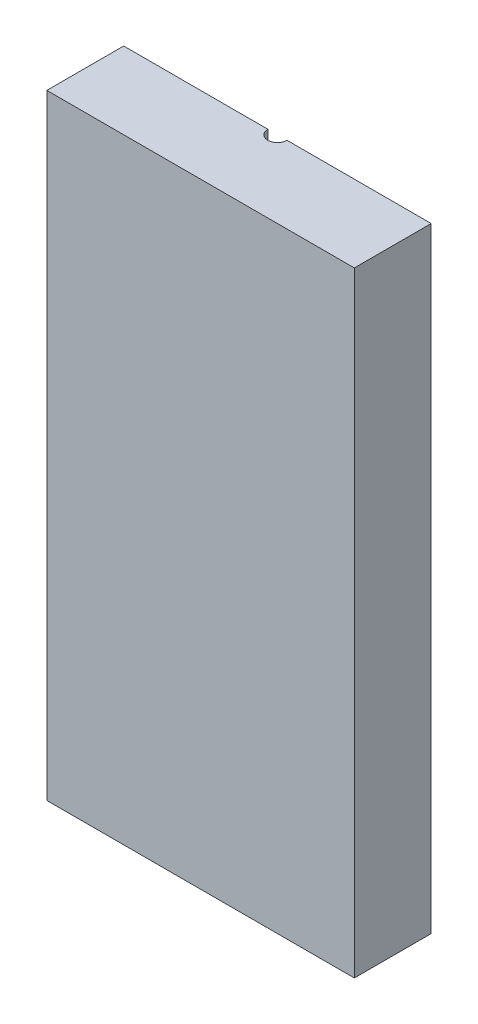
ISO-10303-21;
HEADER;
FILE_DESCRIPTION(('STEP AP214'),'2;1');
FILE_NAME('part.step','',(''),(''),'','','');
FILE_SCHEMA(('AUTOMOTIVE_DESIGN { 1 0 10303 214 1 1 1 1 }'));
ENDSEC;
DATA;
#1=APPLICATION_CONTEXT('core data for automotive mechanical design processes');
#2=APPLICATION_PROTOCOL_DEFINITION('international standard','automotive_design',2000,#1);
#3=PRODUCT_CONTEXT('',#1,'mechanical');
#4=PRODUCT('Part','Part','',(#3));
#5=PRODUCT_RELATED_PRODUCT_CATEGORY('part','',(#4));
#6=PRODUCT_DEFINITION_FORMATION('','',#4);
#7=PRODUCT_DEFINITION_CONTEXT('part definition',#1,'design');
#8=PRODUCT_DEFINITION('design','',#6,#7);
#9=PRODUCT_DEFINITION_SHAPE('','',#8);
#10=(LENGTH_UNIT() NAMED_UNIT(*) SI_UNIT(.MILLI.,.METRE.));
#11=(NAMED_UNIT(*) PLANE_ANGLE_UNIT() SI_UNIT($,.RADIAN.));
#12=(NAMED_UNIT(*) SI_UNIT($,.STERADIAN.) SOLID_ANGLE_UNIT());
#13=UNCERTAINTY_MEASURE_WITH_UNIT(LENGTH_MEASURE(1.E-05),#10,'distance_accuracy_value','');
#14=(GEOMETRIC_REPRESENTATION_CONTEXT(3) GLOBAL_UNCERTAINTY_ASSIGNED_CONTEXT((#13)) GLOBAL_UNIT_ASSIGNED_CONTEXT((#10,
#11,#12)) REPRESENTATION_CONTEXT('',''));
#15=CARTESIAN_POINT('',(0.,0.,0.));
#16=DIRECTION('',(0.,0.,1.));
#17=DIRECTION('',(1.,0.,0.));
#18=AXIS2_PLACEMENT_3D('',#15,#16,#17);
#19=CARTESIAN_POINT('',(12.7,50.8,3.175));
#20=DIRECTION('',(-1.,0.,0.));
#21=DIRECTION('',(0.,0.,1.));
#22=AXIS2_PLACEMENT_3D('',#19,#20,#21);
#23=PLANE('',#22);
#24=DIRECTION('',(0.,0.,-1.));
#25=VECTOR('',#24,1.);
#26=CARTESIAN_POINT('',(12.7,0.,3.175));
#27=LINE('',#26,#25);
#28=CARTESIAN_POINT('',(12.7,0.,3.175));
#29=VERTEX_POINT('',#28);
#30=CARTESIAN_POINT('',(12.7,0.,-3.175));
#31=VERTEX_POINT('',#30);
#32=EDGE_CURVE('E128',#29,#31,#27,.T.);
#33=ORIENTED_EDGE('',*,*,#32,.T.);
#34=DIRECTION('',(0.,-1.,0.));
#35=VECTOR('',#34,1.);
#36=CARTESIAN_POINT('',(12.7,50.8,-3.175));
#37=LINE('',#36,#35);
#38=CARTESIAN_POINT('',(12.7,50.8,-3.175));
#39=VERTEX_POINT('',#38);
#40=EDGE_CURVE('E11',#39,#31,#37,.T.);
#41=ORIENTED_EDGE('',*,*,#40,.F.);
#42=DIRECTION('',(0.,0.,-1.));
#43=VECTOR('',#42,1.);
#44=CARTESIAN_POINT('',(12.7,50.8,3.175));
#45=LINE('',#44,#43);
#46=CARTESIAN_POINT('',(12.7,50.8,3.175));
#47=VERTEX_POINT('',#46);
#48=EDGE_CURVE('E144',#47,#39,#45,.T.);
#49=ORIENTED_EDGE('',*,*,#48,.F.);
#50=DIRECTION('',(0.,-1.,0.));
#51=VECTOR('',#50,1.);
#52=CARTESIAN_POINT('',(12.7,50.8,3.175));
#53=LINE('',#52,#51);
#54=EDGE_CURVE('E124',#47,#29,#53,.T.);
#55=ORIENTED_EDGE('',*,*,#54,.T.);
#56=EDGE_LOOP('',(#33,#41,#49,#55));
#57=FACE_BOUND('',#56,.T.);
#58=ADVANCED_FACE('F39',(#57),#23,.F.);
#59=CARTESIAN_POINT('',(0.793749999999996,50.8,-3.175));
#60=DIRECTION('',(0.,0.,1.));
#61=DIRECTION('',(1.,0.,0.));
#62=AXIS2_PLACEMENT_3D('',#59,#60,#61);
#63=PLANE('',#62);
#64=DIRECTION('',(-1.,0.,0.));
#65=VECTOR('',#64,1.);
#66=CARTESIAN_POINT('',(0.793749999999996,0.,-3.175));
#67=LINE('',#66,#65);
#68=CARTESIAN_POINT('',(0.793749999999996,0.,-3.175));
#69=VERTEX_POINT('',#68);
#70=EDGE_CURVE('E132',#31,#69,#67,.T.);
#71=ORIENTED_EDGE('',*,*,#70,.T.);
#72=DIRECTION('',(0.,-1.,0.));
#73=VECTOR('',#72,1.);
#74=CARTESIAN_POINT('',(0.793749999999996,50.8,-3.175));
#75=LINE('',#74,#73);
#76=CARTESIAN_POINT('',(0.793749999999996,50.8,-3.175));
#77=VERTEX_POINT('',#76);
#78=EDGE_CURVE('E48',#77,#69,#75,.T.);
#79=ORIENTED_EDGE('',*,*,#78,.F.);
#80=DIRECTION('',(-1.,0.,0.));
#81=VECTOR('',#80,1.);
#82=CARTESIAN_POINT('',(0.793749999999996,50.8,-3.175));
#83=LINE('',#82,#81);
#84=EDGE_CURVE('E93',#39,#77,#83,.T.);
#85=ORIENTED_EDGE('',*,*,#84,.F.);
#86=ORIENTED_EDGE('',*,*,#40,.T.);
#87=EDGE_LOOP('',(#71,#79,#85,#86));
#88=FACE_BOUND('',#87,.T.);
#89=ADVANCED_FACE('F172',(#88),#63,.F.);
#90=CARTESIAN_POINT('',(0.,50.8,-3.175));
#91=DIRECTION('',(0.,-1.,0.));
#92=DIRECTION('',(0.,0.,-1.));
#93=AXIS2_PLACEMENT_3D('',#90,#91,#92);
#94=CYLINDRICAL_SURFACE('',#93,0.79375);
#95=CARTESIAN_POINT('',(0.,0.,-3.175));
#96=DIRECTION('',(0.,-1.,0.));
#97=DIRECTION('',(0.,0.,1.));
#98=AXIS2_PLACEMENT_3D('',#95,#96,#97);
#99=CIRCLE('',#98,0.79375);
#100=CARTESIAN_POINT('',(-0.793750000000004,0.,-3.175));
#101=VERTEX_POINT('',#100);
#102=EDGE_CURVE('E135',#69,#101,#99,.T.);
#103=ORIENTED_EDGE('',*,*,#102,.T.);
#104=DIRECTION('',(0.,-1.,0.));
#105=VECTOR('',#104,1.);
#106=CARTESIAN_POINT('',(-0.793750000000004,50.8,-3.175));
#107=LINE('',#106,#105);
#108=CARTESIAN_POINT('',(-0.793750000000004,50.8,-3.175));
#109=VERTEX_POINT('',#108);
#110=EDGE_CURVE('E117',#109,#101,#107,.T.);
#111=ORIENTED_EDGE('',*,*,#110,.F.);
#112=CARTESIAN_POINT('',(0.,50.8,-3.175));
#113=DIRECTION('',(0.,-1.,0.));
#114=DIRECTION('',(0.,0.,1.));
#115=AXIS2_PLACEMENT_3D('',#112,#113,#114);
#116=CIRCLE('',#115,0.79375);
#117=EDGE_CURVE('E106',#77,#109,#116,.T.);
#118=ORIENTED_EDGE('',*,*,#117,.F.);
#119=ORIENTED_EDGE('',*,*,#78,.T.);
#120=EDGE_LOOP('',(#103,#111,#118,#119));
#121=FACE_BOUND('',#120,.T.);
#122=ADVANCED_FACE('F154',(#121),#94,.F.);
#123=CARTESIAN_POINT('',(-12.7,50.8,-3.175));
#124=DIRECTION('',(0.,0.,1.));
#125=DIRECTION('',(1.,0.,0.));
#126=AXIS2_PLACEMENT_3D('',#123,#124,#125);
#127=PLANE('',#126);
#128=DIRECTION('',(-1.,0.,0.));
#129=VECTOR('',#128,1.);
#130=CARTESIAN_POINT('',(-12.7,0.,-3.175));
#131=LINE('',#130,#129);
#132=CARTESIAN_POINT('',(-12.7,0.,-3.175));
#133=VERTEX_POINT('',#132);
#134=EDGE_CURVE('E115',#101,#133,#131,.T.);
#135=ORIENTED_EDGE('',*,*,#134,.T.);
#136=DIRECTION('',(0.,-1.,0.));
#137=VECTOR('',#136,1.);
#138=CARTESIAN_POINT('',(-12.7,50.8,-3.175));
#139=LINE('',#138,#137);
#140=CARTESIAN_POINT('',(-12.7,50.8,-3.175));
#141=VERTEX_POINT('',#140);
#142=EDGE_CURVE('E112',#141,#133,#139,.T.);
#143=ORIENTED_EDGE('',*,*,#142,.F.);
#144=DIRECTION('',(-1.,0.,0.));
#145=VECTOR('',#144,1.);
#146=CARTESIAN_POINT('',(-12.7,50.8,-3.175));
#147=LINE('',#146,#145);
#148=EDGE_CURVE('E100',#109,#141,#147,.T.);
#149=ORIENTED_EDGE('',*,*,#148,.F.);
#150=ORIENTED_EDGE('',*,*,#110,.T.);
#151=EDGE_LOOP('',(#135,#143,#149,#150));
#152=FACE_BOUND('',#151,.T.);
#153=ADVANCED_FACE('F113',(#152),#127,.F.);
#154=CARTESIAN_POINT('',(-12.7,50.8,3.175));
#155=DIRECTION('',(1.,0.,0.));
#156=DIRECTION('',(0.,0.,-1.));
#157=AXIS2_PLACEMENT_3D('',#154,#155,#156);
#158=PLANE('',#157);
#159=DIRECTION('',(0.,0.,1.));
#160=VECTOR('',#159,1.);
#161=CARTESIAN_POINT('',(-12.7,0.,3.175));
#162=LINE('',#161,#160);
#163=CARTESIAN_POINT('',(-12.7,0.,3.175));
#164=VERTEX_POINT('',#163);
#165=EDGE_CURVE('E79',#133,#164,#162,.T.);
#166=ORIENTED_EDGE('',*,*,#165,.T.);
#167=DIRECTION('',(0.,-1.,0.));
#168=VECTOR('',#167,1.);
#169=CARTESIAN_POINT('',(-12.7,50.8,3.175));
#170=LINE('',#169,#168);
#171=CARTESIAN_POINT('',(-12.7,50.8,3.175));
#172=VERTEX_POINT('',#171);
#173=EDGE_CURVE('E118',#172,#164,#170,.T.);
#174=ORIENTED_EDGE('',*,*,#173,.F.);
#175=DIRECTION('',(0.,0.,1.));
#176=VECTOR('',#175,1.);
#177=CARTESIAN_POINT('',(-12.7,50.8,3.175));
#178=LINE('',#177,#176);
#179=EDGE_CURVE('E104',#141,#172,#178,.T.);
#180=ORIENTED_EDGE('',*,*,#179,.F.);
#181=ORIENTED_EDGE('',*,*,#142,.T.);
#182=EDGE_LOOP('',(#166,#174,#180,#181));
#183=FACE_BOUND('',#182,.T.);
#184=ADVANCED_FACE('F120',(#183),#158,.F.);
#185=CARTESIAN_POINT('',(-12.7,50.8,3.175));
#186=DIRECTION('',(0.,0.,-1.));
#187=DIRECTION('',(-1.,0.,0.));
#188=AXIS2_PLACEMENT_3D('',#185,#186,#187);
#189=PLANE('',#188);
#190=DIRECTION('',(1.,0.,0.));
#191=VECTOR('',#190,1.);
#192=CARTESIAN_POINT('',(-12.7,0.,3.175));
#193=LINE('',#192,#191);
#194=EDGE_CURVE('E85',#164,#29,#193,.T.);
#195=ORIENTED_EDGE('',*,*,#194,.T.);
#196=ORIENTED_EDGE('',*,*,#54,.F.);
#197=DIRECTION('',(1.,0.,0.));
#198=VECTOR('',#197,1.);
#199=CARTESIAN_POINT('',(-12.7,50.8,3.175));
#200=LINE('',#199,#198);
#201=EDGE_CURVE('E56',#172,#47,#200,.T.);
#202=ORIENTED_EDGE('',*,*,#201,.F.);
#203=ORIENTED_EDGE('',*,*,#173,.T.);
#204=EDGE_LOOP('',(#195,#196,#202,#203));
#205=FACE_BOUND('',#204,.T.);
#206=ADVANCED_FACE('F161',(#205),#189,.F.);
#207=CARTESIAN_POINT('',(0.,50.8,-3.175));
#208=DIRECTION('',(0.,1.,0.));
#209=DIRECTION('',(0.,0.,1.));
#210=AXIS2_PLACEMENT_3D('',#207,#208,#209);
#211=PLANE('',#210);
#212=ORIENTED_EDGE('',*,*,#48,.T.);
#213=ORIENTED_EDGE('',*,*,#84,.T.);
#214=ORIENTED_EDGE('',*,*,#117,.T.);
#215=ORIENTED_EDGE('',*,*,#148,.T.);
#216=ORIENTED_EDGE('',*,*,#179,.T.);
#217=ORIENTED_EDGE('',*,*,#201,.T.);
#218=EDGE_LOOP('',(#212,#213,#214,#215,#216,#217));
#219=FACE_BOUND('',#218,.T.);
#220=ADVANCED_FACE('F102',(#219),#211,.T.);
#221=CARTESIAN_POINT('',(0.,0.,-3.175));
#222=DIRECTION('',(0.,1.,0.));
#223=DIRECTION('',(0.,0.,1.));
#224=AXIS2_PLACEMENT_3D('',#221,#222,#223);
#225=PLANE('',#224);
#226=ORIENTED_EDGE('',*,*,#32,.F.);
#227=ORIENTED_EDGE('',*,*,#194,.F.);
#228=ORIENTED_EDGE('',*,*,#165,.F.);
#229=ORIENTED_EDGE('',*,*,#134,.F.);
#230=ORIENTED_EDGE('',*,*,#102,.F.);
#231=ORIENTED_EDGE('',*,*,#70,.F.);
#232=EDGE_LOOP('',(#226,#227,#228,#229,#230,#231));
#233=FACE_BOUND('',#232,.T.);
#234=ADVANCED_FACE('F157',(#233),#225,.F.);
#235=CLOSED_SHELL('',(#58,#89,#122,#153,#184,#206,#220,#234));
#236=MANIFOLD_SOLID_BREP('B2',#235);
#237=ADVANCED_BREP_SHAPE_REPRESENTATION('',(#18,#236),#14);
#238=SHAPE_DEFINITION_REPRESENTATION(#9,#237);
ENDSEC;
END-ISO-10303-21;
